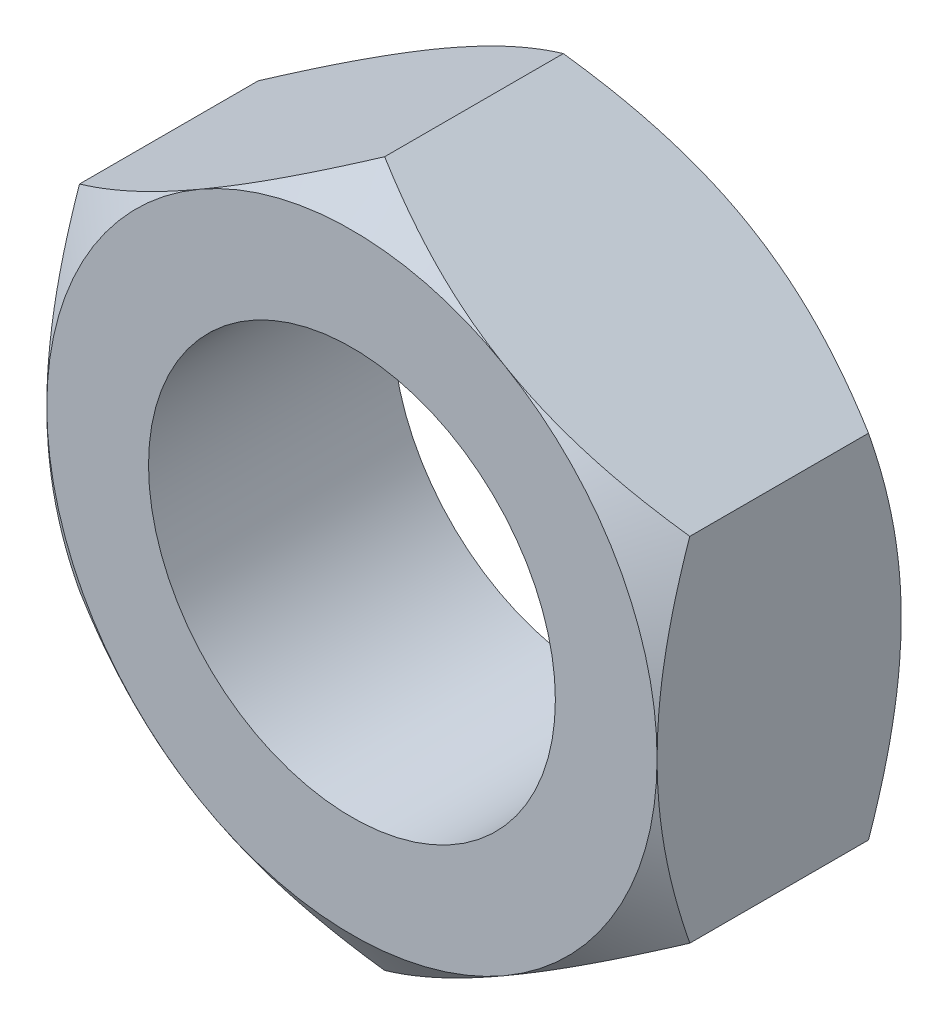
ISO-10303-21;
HEADER;
FILE_DESCRIPTION(('STEP AP214'),'2;1');
FILE_NAME('part.step','',(''),(''),'','','');
FILE_SCHEMA(('AUTOMOTIVE_DESIGN { 1 0 10303 214 1 1 1 1 }'));
ENDSEC;
DATA;
#1=APPLICATION_CONTEXT('core data for automotive mechanical design processes');
#2=APPLICATION_PROTOCOL_DEFINITION('international standard','automotive_design',2000,#1);
#3=PRODUCT_CONTEXT('',#1,'mechanical');
#4=PRODUCT('Part','Part','',(#3));
#5=PRODUCT_RELATED_PRODUCT_CATEGORY('part','',(#4));
#6=PRODUCT_DEFINITION_FORMATION('','',#4);
#7=PRODUCT_DEFINITION_CONTEXT('part definition',#1,'design');
#8=PRODUCT_DEFINITION('design','',#6,#7);
#9=PRODUCT_DEFINITION_SHAPE('','',#8);
#10=(LENGTH_UNIT() NAMED_UNIT(*) SI_UNIT(.MILLI.,.METRE.));
#11=(NAMED_UNIT(*) PLANE_ANGLE_UNIT() SI_UNIT($,.RADIAN.));
#12=(NAMED_UNIT(*) SI_UNIT($,.STERADIAN.) SOLID_ANGLE_UNIT());
#13=UNCERTAINTY_MEASURE_WITH_UNIT(LENGTH_MEASURE(1.E-05),#10,'distance_accuracy_value','');
#14=(GEOMETRIC_REPRESENTATION_CONTEXT(3) GLOBAL_UNCERTAINTY_ASSIGNED_CONTEXT((#13)) GLOBAL_UNIT_ASSIGNED_CONTEXT((#10,
#11,#12)) REPRESENTATION_CONTEXT('',''));
#15=CARTESIAN_POINT('',(0.,0.,0.));
#16=DIRECTION('',(0.,0.,1.));
#17=DIRECTION('',(1.,0.,0.));
#18=AXIS2_PLACEMENT_3D('',#15,#16,#17);
#19=CARTESIAN_POINT('',(0.,17.3205080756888,12.));
#20=DIRECTION('',(0.,0.,1.));
#21=DIRECTION('',(1.,0.,0.));
#22=AXIS2_PLACEMENT_3D('',#19,#20,#21);
#23=PLANE('',#22);
#24=CARTESIAN_POINT('',(0.,0.,12.));
#25=DIRECTION('',(0.,0.,-1.));
#26=DIRECTION('',(-1.,0.,0.));
#27=AXIS2_PLACEMENT_3D('',#24,#25,#26);
#28=CIRCLE('',#27,15.);
#29=CARTESIAN_POINT('',(15.,0.,12.));
#30=VERTEX_POINT('',#29);
#31=CARTESIAN_POINT('',(7.5,-12.9903810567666,12.));
#32=VERTEX_POINT('',#31);
#33=EDGE_CURVE('E116',#30,#32,#28,.T.);
#34=ORIENTED_EDGE('',*,*,#33,.F.);
#35=CARTESIAN_POINT('',(0.,0.,12.));
#36=DIRECTION('',(0.,0.,-1.));
#37=DIRECTION('',(-1.,0.,0.));
#38=AXIS2_PLACEMENT_3D('',#35,#36,#37);
#39=CIRCLE('',#38,15.);
#40=CARTESIAN_POINT('',(7.5,12.9903810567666,12.));
#41=VERTEX_POINT('',#40);
#42=EDGE_CURVE('E107',#41,#30,#39,.T.);
#43=ORIENTED_EDGE('',*,*,#42,.F.);
#44=CARTESIAN_POINT('',(0.,0.,12.));
#45=DIRECTION('',(0.,0.,-1.));
#46=DIRECTION('',(-1.,0.,0.));
#47=AXIS2_PLACEMENT_3D('',#44,#45,#46);
#48=CIRCLE('',#47,15.);
#49=CARTESIAN_POINT('',(-7.5,12.9903810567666,12.));
#50=VERTEX_POINT('',#49);
#51=EDGE_CURVE('E115',#50,#41,#48,.T.);
#52=ORIENTED_EDGE('',*,*,#51,.F.);
#53=CARTESIAN_POINT('',(0.,0.,12.));
#54=DIRECTION('',(0.,0.,-1.));
#55=DIRECTION('',(-1.,0.,0.));
#56=AXIS2_PLACEMENT_3D('',#53,#54,#55);
#57=CIRCLE('',#56,15.);
#58=CARTESIAN_POINT('',(-15.,0.,12.));
#59=VERTEX_POINT('',#58);
#60=EDGE_CURVE('E39',#59,#50,#57,.T.);
#61=ORIENTED_EDGE('',*,*,#60,.F.);
#62=CARTESIAN_POINT('',(0.,0.,12.));
#63=DIRECTION('',(0.,0.,-1.));
#64=DIRECTION('',(-1.,0.,0.));
#65=AXIS2_PLACEMENT_3D('',#62,#63,#64);
#66=CIRCLE('',#65,15.);
#67=CARTESIAN_POINT('',(-7.5,-12.9903810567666,12.));
#68=VERTEX_POINT('',#67);
#69=EDGE_CURVE('E138',#68,#59,#66,.T.);
#70=ORIENTED_EDGE('',*,*,#69,.F.);
#71=CARTESIAN_POINT('',(0.,0.,12.));
#72=DIRECTION('',(0.,0.,-1.));
#73=DIRECTION('',(-1.,0.,0.));
#74=AXIS2_PLACEMENT_3D('',#71,#72,#73);
#75=CIRCLE('',#74,15.);
#76=EDGE_CURVE('E136',#32,#68,#75,.T.);
#77=ORIENTED_EDGE('',*,*,#76,.F.);
#78=EDGE_LOOP('',(#34,#43,#52,#61,#70,#77));
#79=FACE_BOUND('',#78,.T.);
#80=CARTESIAN_POINT('',(0.,0.,12.));
#81=DIRECTION('',(0.,0.,1.));
#82=DIRECTION('',(1.,0.,0.));
#83=AXIS2_PLACEMENT_3D('',#80,#81,#82);
#84=CIRCLE('',#83,10.);
#85=CARTESIAN_POINT('',(10.,0.,12.));
#86=VERTEX_POINT('',#85);
#87=EDGE_CURVE('E144',#86,#86,#84,.T.);
#88=ORIENTED_EDGE('',*,*,#87,.F.);
#89=EDGE_LOOP('',(#88));
#90=FACE_BOUND('',#89,.T.);
#91=ADVANCED_FACE('F14',(#79,#90),#23,.T.);
#92=CARTESIAN_POINT('',(0.,17.3205080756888,0.));
#93=DIRECTION('',(0.,0.,1.));
#94=DIRECTION('',(1.,0.,0.));
#95=AXIS2_PLACEMENT_3D('',#92,#93,#94);
#96=PLANE('',#95);
#97=CARTESIAN_POINT('',(0.,0.,0.));
#98=DIRECTION('',(0.,0.,-1.));
#99=DIRECTION('',(-1.,0.,0.));
#100=AXIS2_PLACEMENT_3D('',#97,#98,#99);
#101=CIRCLE('',#100,15.);
#102=CARTESIAN_POINT('',(7.5,12.9903810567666,0.));
#103=VERTEX_POINT('',#102);
#104=CARTESIAN_POINT('',(15.,0.,0.));
#105=VERTEX_POINT('',#104);
#106=EDGE_CURVE('E275',#103,#105,#101,.T.);
#107=ORIENTED_EDGE('',*,*,#106,.T.);
#108=CARTESIAN_POINT('',(0.,0.,0.));
#109=DIRECTION('',(0.,0.,-1.));
#110=DIRECTION('',(-1.,0.,0.));
#111=AXIS2_PLACEMENT_3D('',#108,#109,#110);
#112=CIRCLE('',#111,15.);
#113=CARTESIAN_POINT('',(7.5,-12.9903810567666,0.));
#114=VERTEX_POINT('',#113);
#115=EDGE_CURVE('E282',#105,#114,#112,.T.);
#116=ORIENTED_EDGE('',*,*,#115,.T.);
#117=CARTESIAN_POINT('',(0.,0.,0.));
#118=DIRECTION('',(0.,0.,-1.));
#119=DIRECTION('',(-1.,0.,0.));
#120=AXIS2_PLACEMENT_3D('',#117,#118,#119);
#121=CIRCLE('',#120,15.);
#122=CARTESIAN_POINT('',(-7.5,-12.9903810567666,0.));
#123=VERTEX_POINT('',#122);
#124=EDGE_CURVE('E288',#114,#123,#121,.T.);
#125=ORIENTED_EDGE('',*,*,#124,.T.);
#126=CARTESIAN_POINT('',(0.,0.,0.));
#127=DIRECTION('',(0.,0.,-1.));
#128=DIRECTION('',(-1.,0.,0.));
#129=AXIS2_PLACEMENT_3D('',#126,#127,#128);
#130=CIRCLE('',#129,15.);
#131=CARTESIAN_POINT('',(-15.,0.,0.));
#132=VERTEX_POINT('',#131);
#133=EDGE_CURVE('E307',#123,#132,#130,.T.);
#134=ORIENTED_EDGE('',*,*,#133,.T.);
#135=CARTESIAN_POINT('',(0.,0.,0.));
#136=DIRECTION('',(0.,0.,-1.));
#137=DIRECTION('',(-1.,0.,0.));
#138=AXIS2_PLACEMENT_3D('',#135,#136,#137);
#139=CIRCLE('',#138,15.);
#140=CARTESIAN_POINT('',(-7.5,12.9903810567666,0.));
#141=VERTEX_POINT('',#140);
#142=EDGE_CURVE('E296',#132,#141,#139,.T.);
#143=ORIENTED_EDGE('',*,*,#142,.T.);
#144=CARTESIAN_POINT('',(0.,0.,0.));
#145=DIRECTION('',(0.,0.,-1.));
#146=DIRECTION('',(-1.,0.,0.));
#147=AXIS2_PLACEMENT_3D('',#144,#145,#146);
#148=CIRCLE('',#147,15.);
#149=EDGE_CURVE('E294',#141,#103,#148,.T.);
#150=ORIENTED_EDGE('',*,*,#149,.T.);
#151=EDGE_LOOP('',(#107,#116,#125,#134,#143,#150));
#152=FACE_BOUND('',#151,.T.);
#153=CARTESIAN_POINT('',(0.,0.,0.));
#154=DIRECTION('',(0.,0.,1.));
#155=DIRECTION('',(1.,0.,0.));
#156=AXIS2_PLACEMENT_3D('',#153,#154,#155);
#157=CIRCLE('',#156,10.);
#158=CARTESIAN_POINT('',(10.,0.,0.));
#159=VERTEX_POINT('',#158);
#160=EDGE_CURVE('E147',#159,#159,#157,.T.);
#161=ORIENTED_EDGE('',*,*,#160,.T.);
#162=EDGE_LOOP('',(#161));
#163=FACE_BOUND('',#162,.T.);
#164=ADVANCED_FACE('F291',(#152,#163),#96,.F.);
#165=CARTESIAN_POINT('',(15.,8.66025403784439,12.));
#166=DIRECTION('',(-0.5,-0.866025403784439,0.));
#167=DIRECTION('',(0.866025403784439,-0.5,0.));
#168=AXIS2_PLACEMENT_3D('',#165,#166,#167);
#169=PLANE('',#168);
#170=DIRECTION('',(0.,0.,-1.));
#171=VECTOR('',#170,1.);
#172=CARTESIAN_POINT('',(0.,17.3205080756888,12.));
#173=LINE('',#172,#171);
#174=CARTESIAN_POINT('',(0.,17.3205080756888,10.3923048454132));
#175=VERTEX_POINT('',#174);
#176=CARTESIAN_POINT('',(0.,17.3205080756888,1.60769515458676));
#177=VERTEX_POINT('',#176);
#178=EDGE_CURVE('E148',#175,#177,#173,.T.);
#179=ORIENTED_EDGE('',*,*,#178,.F.);
#180=CARTESIAN_POINT('',(0.,17.3205080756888,10.3923048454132));
#181=CARTESIAN_POINT('',(0.302482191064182,17.1458699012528,10.5132845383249));
#182=CARTESIAN_POINT('',(0.606465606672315,16.9703649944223,10.6294015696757));
#183=CARTESIAN_POINT('',(1.21755962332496,16.6175496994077,10.8505296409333));
#184=CARTESIAN_POINT('',(1.52467130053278,16.4402386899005,10.9555367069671));
#185=CARTESIAN_POINT('',(2.13971794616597,16.08514134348,11.1522680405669));
#186=CARTESIAN_POINT('',(2.44763122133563,15.9073675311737,11.2440821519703));
#187=CARTESIAN_POINT('',(3.06629979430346,15.5501790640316,11.4138304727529));
#188=CARTESIAN_POINT('',(3.37705484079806,15.3707645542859,11.491765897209));
#189=CARTESIAN_POINT('',(4.00171979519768,15.0101140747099,11.6324382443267));
#190=CARTESIAN_POINT('',(4.31563429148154,14.8288754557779,11.6951481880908));
#191=CARTESIAN_POINT('',(4.94562238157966,14.4651516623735,11.8038505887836));
#192=CARTESIAN_POINT('',(5.26169587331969,14.2826665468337,11.8498438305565));
#193=CARTESIAN_POINT('',(5.89767078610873,13.9154862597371,11.9242852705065));
#194=CARTESIAN_POINT('',(6.2175834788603,13.7307845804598,11.952607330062));
#195=CARTESIAN_POINT('',(6.69810191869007,13.4533571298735,11.9810040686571));
#196=CARTESIAN_POINT('',(6.85841465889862,13.3608005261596,11.9881219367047));
#197=CARTESIAN_POINT('',(7.17914916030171,13.1756243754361,11.9976218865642));
#198=CARTESIAN_POINT('',(7.33957092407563,13.0830048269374,12.0000038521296));
#199=CARTESIAN_POINT('',(7.5,12.9903810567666,12.));
#200=B_SPLINE_CURVE_WITH_KNOTS('',3,(#180,#181,#182,#183,#184,#185,#186,#187,#188,#189,#190,
#191,#192,#193,#194,#195,#196,#197,#198,#199),.UNSPECIFIED.,.F.,.F.,(4,2,2,2,2,2,2,2,2,4),(0.,
1.10893848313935,2.21827228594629,3.31965174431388,4.42093472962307,5.52415512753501,
6.6273237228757,7.7382793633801,8.29397650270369,8.84968728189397),.UNSPECIFIED.);
#201=EDGE_CURVE('E151',#175,#41,#200,.T.);
#202=ORIENTED_EDGE('',*,*,#201,.T.);
#203=CARTESIAN_POINT('',(7.5,12.9903810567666,12.));
#204=CARTESIAN_POINT('',(7.77919360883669,12.8291885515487,12.0000495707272));
#205=CARTESIAN_POINT('',(8.05837338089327,12.6680040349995,11.9928006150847));
#206=CARTESIAN_POINT('',(8.61612789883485,12.3459843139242,11.9640744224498));
#207=CARTESIAN_POINT('',(8.8947027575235,12.1851490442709,11.9426001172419));
#208=CARTESIAN_POINT('',(9.45029688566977,11.8643766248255,11.8858416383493));
#209=CARTESIAN_POINT('',(9.72731802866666,11.704438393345,11.8505818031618));
#210=CARTESIAN_POINT('',(10.2798627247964,11.3854265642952,11.76693101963));
#211=CARTESIAN_POINT('',(10.5553862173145,11.2263530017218,11.7185395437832));
#212=CARTESIAN_POINT('',(11.3736423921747,10.7539325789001,11.5559786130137));
#213=CARTESIAN_POINT('',(11.9137344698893,10.4421102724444,11.4238104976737));
#214=CARTESIAN_POINT('',(12.9851128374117,9.82354968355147,11.1186816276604));
#215=CARTESIAN_POINT('',(13.5163977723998,9.51681218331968,10.9457146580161));
#216=CARTESIAN_POINT('',(14.2032811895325,9.12023985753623,10.6985172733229));
#217=CARTESIAN_POINT('',(14.3630469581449,9.02799904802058,10.6393337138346));
#218=CARTESIAN_POINT('',(14.6820087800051,8.84384635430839,10.5179888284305));
#219=CARTESIAN_POINT('',(14.8412035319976,8.75193522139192,10.4558229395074));
#220=CARTESIAN_POINT('',(15.,8.66025403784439,10.3923048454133));
#221=B_SPLINE_CURVE_WITH_KNOTS('',3,(#203,#204,#205,#206,#207,#208,#209,#210,#211,#212,#213,
#214,#215,#216,#217,#218,#219,#220),.UNSPECIFIED.,.F.,.F.,(4,2,2,2,2,2,2,2,4),(0.,
0.967047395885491,1.93389554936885,2.89904437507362,3.86423197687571,5.77492419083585,
7.68590765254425,8.26712208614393,8.8492560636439),.UNSPECIFIED.);
#222=CARTESIAN_POINT('',(15.,8.66025403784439,10.3923048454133));
#223=VERTEX_POINT('',#222);
#224=EDGE_CURVE('E110',#41,#223,#221,.T.);
#225=ORIENTED_EDGE('',*,*,#224,.T.);
#226=DIRECTION('',(0.,0.,-1.));
#227=VECTOR('',#226,1.);
#228=CARTESIAN_POINT('',(15.,8.66025403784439,12.));
#229=LINE('',#228,#227);
#230=CARTESIAN_POINT('',(15.,8.66025403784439,1.60769515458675));
#231=VERTEX_POINT('',#230);
#232=EDGE_CURVE('E132',#223,#231,#229,.T.);
#233=ORIENTED_EDGE('',*,*,#232,.T.);
#234=CARTESIAN_POINT('',(15.,8.66025403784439,1.60769515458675));
#235=CARTESIAN_POINT('',(14.6975178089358,8.83489221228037,1.48671546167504));
#236=CARTESIAN_POINT('',(14.3935343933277,9.01039711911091,1.37059843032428));
#237=CARTESIAN_POINT('',(13.782440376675,9.36321241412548,1.14947035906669));
#238=CARTESIAN_POINT('',(13.4753286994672,9.54052342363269,1.04446329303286));
#239=CARTESIAN_POINT('',(12.860282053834,9.89562077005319,0.847731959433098));
#240=CARTESIAN_POINT('',(12.5523687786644,10.0733945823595,0.755917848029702));
#241=CARTESIAN_POINT('',(11.9337002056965,10.4305830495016,0.586169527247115));
#242=CARTESIAN_POINT('',(11.6229451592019,10.6099975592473,0.508234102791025));
#243=CARTESIAN_POINT('',(10.9982802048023,10.9706480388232,0.367561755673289));
#244=CARTESIAN_POINT('',(10.6843657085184,11.1518866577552,0.304851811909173));
#245=CARTESIAN_POINT('',(10.0543776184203,11.5156104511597,0.196149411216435));
#246=CARTESIAN_POINT('',(9.73830412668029,11.6980955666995,0.150156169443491));
#247=CARTESIAN_POINT('',(9.10232921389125,12.0652758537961,0.0757147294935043));
#248=CARTESIAN_POINT('',(8.78241652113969,12.2499775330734,0.0473926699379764));
#249=CARTESIAN_POINT('',(8.30189808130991,12.5274049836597,0.0189959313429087));
#250=CARTESIAN_POINT('',(8.14158534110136,12.6199615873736,0.0118780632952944));
#251=CARTESIAN_POINT('',(7.82085083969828,12.8051377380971,0.00237811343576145));
#252=CARTESIAN_POINT('',(7.66042907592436,12.8977572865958,-3.85212960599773E-06));
#253=CARTESIAN_POINT('',(7.5,12.9903810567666,0.));
#254=B_SPLINE_CURVE_WITH_KNOTS('',3,(#234,#235,#236,#237,#238,#239,#240,#241,#242,#243,#244,
#245,#246,#247,#248,#249,#250,#251,#252,#253),.UNSPECIFIED.,.F.,.F.,(4,2,2,2,2,2,2,2,2,4),(0.,
1.10893848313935,2.21827228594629,3.31965174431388,4.42093472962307,5.52415512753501,
6.6273237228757,7.7382793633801,8.29397650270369,8.84968728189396),.UNSPECIFIED.);
#255=EDGE_CURVE('E278',#231,#103,#254,.T.);
#256=ORIENTED_EDGE('',*,*,#255,.T.);
#257=CARTESIAN_POINT('',(7.5,12.9903810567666,0.));
#258=CARTESIAN_POINT('',(7.2208063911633,13.1515735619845,-4.95707271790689E-05));
#259=CARTESIAN_POINT('',(6.94162661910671,13.3127580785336,0.00719938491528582));
#260=CARTESIAN_POINT('',(6.38387210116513,13.6347777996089,0.0359255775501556));
#261=CARTESIAN_POINT('',(6.10529724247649,13.7956130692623,0.0573998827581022));
#262=CARTESIAN_POINT('',(5.54970311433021,14.1163854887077,0.114158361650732));
#263=CARTESIAN_POINT('',(5.27268197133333,14.2763237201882,0.149418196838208));
#264=CARTESIAN_POINT('',(4.72013727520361,14.595335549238,0.233068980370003));
#265=CARTESIAN_POINT('',(4.44461378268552,14.7544091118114,0.281460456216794));
#266=CARTESIAN_POINT('',(3.62635760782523,15.226829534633,0.44402138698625));
#267=CARTESIAN_POINT('',(3.08626553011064,15.5386518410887,0.576189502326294));
#268=CARTESIAN_POINT('',(2.0148871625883,16.1572124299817,0.881318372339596));
#269=CARTESIAN_POINT('',(1.48360222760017,16.4639499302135,1.05428534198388));
#270=CARTESIAN_POINT('',(0.796718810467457,16.860522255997,1.3014827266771));
#271=CARTESIAN_POINT('',(0.636953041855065,16.9527630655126,1.36066628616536));
#272=CARTESIAN_POINT('',(0.317991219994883,17.1369157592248,1.48201117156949));
#273=CARTESIAN_POINT('',(0.158796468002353,17.2288268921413,1.5441770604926));
#274=CARTESIAN_POINT('',(0.,17.3205080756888,1.60769515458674));
#275=B_SPLINE_CURVE_WITH_KNOTS('',3,(#257,#258,#259,#260,#261,#262,#263,#264,#265,#266,#267,
#268,#269,#270,#271,#272,#273,#274),.UNSPECIFIED.,.F.,.F.,(4,2,2,2,2,2,2,2,4),(0.,
0.967047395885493,1.93389554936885,2.89904437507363,3.86423197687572,5.77492419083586,
7.68590765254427,8.26712208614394,8.84925606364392),.UNSPECIFIED.);
#276=EDGE_CURVE('E299',#103,#177,#275,.T.);
#277=ORIENTED_EDGE('',*,*,#276,.T.);
#278=EDGE_LOOP('',(#179,#202,#225,#233,#256,#277));
#279=FACE_BOUND('',#278,.T.);
#280=ADVANCED_FACE('F165',(#279),#169,.F.);
#281=CARTESIAN_POINT('',(0.,17.3205080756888,12.));
#282=DIRECTION('',(0.5,-0.866025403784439,0.));
#283=DIRECTION('',(0.866025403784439,0.5,0.));
#284=AXIS2_PLACEMENT_3D('',#281,#282,#283);
#285=PLANE('',#284);
#286=DIRECTION('',(0.,0.,-1.));
#287=VECTOR('',#286,1.);
#288=CARTESIAN_POINT('',(-15.,8.66025403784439,12.));
#289=LINE('',#288,#287);
#290=CARTESIAN_POINT('',(-15.,8.66025403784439,10.3923048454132));
#291=VERTEX_POINT('',#290);
#292=CARTESIAN_POINT('',(-15.,8.66025403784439,1.60769515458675));
#293=VERTEX_POINT('',#292);
#294=EDGE_CURVE('E150',#291,#293,#289,.T.);
#295=ORIENTED_EDGE('',*,*,#294,.F.);
#296=CARTESIAN_POINT('',(-15.,8.66025403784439,10.3923048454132));
#297=CARTESIAN_POINT('',(-14.6975178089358,8.83489221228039,10.5132845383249));
#298=CARTESIAN_POINT('',(-14.3935343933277,9.01039711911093,10.6294015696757));
#299=CARTESIAN_POINT('',(-13.782440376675,9.36321241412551,10.8505296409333));
#300=CARTESIAN_POINT('',(-13.4753286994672,9.54052342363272,10.9555367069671));
#301=CARTESIAN_POINT('',(-12.860282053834,9.89562077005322,11.1522680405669));
#302=CARTESIAN_POINT('',(-12.5523687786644,10.0733945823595,11.2440821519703));
#303=CARTESIAN_POINT('',(-11.9337002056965,10.4305830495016,11.4138304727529));
#304=CARTESIAN_POINT('',(-11.6229451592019,10.6099975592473,11.4917658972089));
#305=CARTESIAN_POINT('',(-10.9982802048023,10.9706480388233,11.6324382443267));
#306=CARTESIAN_POINT('',(-10.6843657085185,11.1518866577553,11.6951481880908));
#307=CARTESIAN_POINT('',(-10.0543776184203,11.5156104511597,11.8038505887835));
#308=CARTESIAN_POINT('',(-9.7383041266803,11.6980955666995,11.8498438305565));
#309=CARTESIAN_POINT('',(-9.10232921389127,12.0652758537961,11.9242852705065));
#310=CARTESIAN_POINT('',(-8.7824165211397,12.2499775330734,11.952607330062));
#311=CARTESIAN_POINT('',(-8.30189808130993,12.5274049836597,11.9810040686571));
#312=CARTESIAN_POINT('',(-8.14158534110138,12.6199615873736,11.9881219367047));
#313=CARTESIAN_POINT('',(-7.82085083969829,12.8051377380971,11.9976218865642));
#314=CARTESIAN_POINT('',(-7.66042907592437,12.8977572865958,12.0000038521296));
#315=CARTESIAN_POINT('',(-7.5,12.9903810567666,12.));
#316=B_SPLINE_CURVE_WITH_KNOTS('',3,(#296,#297,#298,#299,#300,#301,#302,#303,#304,#305,#306,
#307,#308,#309,#310,#311,#312,#313,#314,#315),.UNSPECIFIED.,.F.,.F.,(4,2,2,2,2,2,2,2,2,4),(0.,
1.10893848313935,2.21827228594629,3.31965174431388,4.42093472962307,5.52415512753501,
6.6273237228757,7.7382793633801,8.29397650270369,8.84968728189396),.UNSPECIFIED.);
#317=EDGE_CURVE('E180',#291,#50,#316,.T.);
#318=ORIENTED_EDGE('',*,*,#317,.T.);
#319=CARTESIAN_POINT('',(-7.5,12.9903810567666,12.));
#320=CARTESIAN_POINT('',(-7.22080639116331,13.1515735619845,12.0000495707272));
#321=CARTESIAN_POINT('',(-6.94162661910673,13.3127580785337,11.9928006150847));
#322=CARTESIAN_POINT('',(-6.38387210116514,13.634777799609,11.9640744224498));
#323=CARTESIAN_POINT('',(-6.1052972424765,13.7956130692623,11.9426001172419));
#324=CARTESIAN_POINT('',(-5.54970311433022,14.1163854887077,11.8858416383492));
#325=CARTESIAN_POINT('',(-5.27268197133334,14.2763237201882,11.8505818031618));
#326=CARTESIAN_POINT('',(-4.72013727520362,14.595335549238,11.76693101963));
#327=CARTESIAN_POINT('',(-4.44461378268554,14.7544091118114,11.7185395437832));
#328=CARTESIAN_POINT('',(-3.62635760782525,15.2268295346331,11.5559786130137));
#329=CARTESIAN_POINT('',(-3.08626553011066,15.5386518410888,11.4238104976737));
#330=CARTESIAN_POINT('',(-2.0148871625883,16.1572124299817,11.1186816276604));
#331=CARTESIAN_POINT('',(-1.48360222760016,16.4639499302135,10.9457146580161));
#332=CARTESIAN_POINT('',(-0.796718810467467,16.860522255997,10.6985172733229));
#333=CARTESIAN_POINT('',(-0.636953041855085,16.9527630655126,10.6393337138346));
#334=CARTESIAN_POINT('',(-0.317991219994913,17.1369157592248,10.5179888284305));
#335=CARTESIAN_POINT('',(-0.158796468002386,17.2288268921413,10.4558229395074));
#336=CARTESIAN_POINT('',(0.,17.3205080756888,10.3923048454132));
#337=B_SPLINE_CURVE_WITH_KNOTS('',3,(#319,#320,#321,#322,#323,#324,#325,#326,#327,#328,#329,
#330,#331,#332,#333,#334,#335,#336),.UNSPECIFIED.,.F.,.F.,(4,2,2,2,2,2,2,2,4),(0.,
0.967047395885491,1.93389554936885,2.89904437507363,3.86423197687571,5.77492419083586,
7.68590765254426,8.26712208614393,8.84925606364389),.UNSPECIFIED.);
#338=EDGE_CURVE('E188',#50,#175,#337,.T.);
#339=ORIENTED_EDGE('',*,*,#338,.T.);
#340=ORIENTED_EDGE('',*,*,#178,.T.);
#341=CARTESIAN_POINT('',(0.,17.3205080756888,1.60769515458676));
#342=CARTESIAN_POINT('',(-0.302482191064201,17.1458699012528,1.48671546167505));
#343=CARTESIAN_POINT('',(-0.606465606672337,16.9703649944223,1.37059843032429));
#344=CARTESIAN_POINT('',(-1.21755962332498,16.6175496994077,1.14947035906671));
#345=CARTESIAN_POINT('',(-1.5246713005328,16.4402386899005,1.04446329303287));
#346=CARTESIAN_POINT('',(-2.13971794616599,16.08514134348,0.847731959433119));
#347=CARTESIAN_POINT('',(-2.44763122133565,15.9073675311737,0.755917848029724));
#348=CARTESIAN_POINT('',(-3.06629979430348,15.5501790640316,0.586169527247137));
#349=CARTESIAN_POINT('',(-3.37705484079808,15.3707645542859,0.508234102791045));
#350=CARTESIAN_POINT('',(-4.0017197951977,15.01011407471,0.367561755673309));
#351=CARTESIAN_POINT('',(-4.31563429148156,14.828875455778,0.304851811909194));
#352=CARTESIAN_POINT('',(-4.94562238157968,14.4651516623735,0.196149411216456));
#353=CARTESIAN_POINT('',(-5.26169587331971,14.2826665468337,0.150156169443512));
#354=CARTESIAN_POINT('',(-5.89767078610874,13.9154862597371,0.0757147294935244));
#355=CARTESIAN_POINT('',(-6.21758347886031,13.7307845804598,0.0473926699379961));
#356=CARTESIAN_POINT('',(-6.69810191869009,13.4533571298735,0.0189959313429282));
#357=CARTESIAN_POINT('',(-6.85841465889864,13.3608005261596,0.0118780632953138));
#358=CARTESIAN_POINT('',(-7.17914916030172,13.1756243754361,0.00237811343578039));
#359=CARTESIAN_POINT('',(-7.33957092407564,13.0830048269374,-3.85212958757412E-06));
#360=CARTESIAN_POINT('',(-7.5,12.9903810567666,0.));
#361=B_SPLINE_CURVE_WITH_KNOTS('',3,(#341,#342,#343,#344,#345,#346,#347,#348,#349,#350,#351,
#352,#353,#354,#355,#356,#357,#358,#359,#360),.UNSPECIFIED.,.F.,.F.,(4,2,2,2,2,2,2,2,2,4),(0.,
1.10893848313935,2.21827228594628,3.31965174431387,4.42093472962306,5.524155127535,
6.62732372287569,7.73827936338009,8.29397650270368,8.84968728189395),.UNSPECIFIED.);
#362=EDGE_CURVE('E332',#177,#141,#361,.T.);
#363=ORIENTED_EDGE('',*,*,#362,.T.);
#364=CARTESIAN_POINT('',(-7.5,12.9903810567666,0.));
#365=CARTESIAN_POINT('',(-7.7791936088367,12.8291885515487,-4.95707271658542E-05));
#366=CARTESIAN_POINT('',(-8.05837338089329,12.6680040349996,0.00719938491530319));
#367=CARTESIAN_POINT('',(-8.61612789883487,12.3459843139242,0.0359255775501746));
#368=CARTESIAN_POINT('',(-8.89470275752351,12.1851490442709,0.0573998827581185));
#369=CARTESIAN_POINT('',(-9.45029688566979,11.8643766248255,0.114158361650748));
#370=CARTESIAN_POINT('',(-9.72731802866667,11.704438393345,0.149418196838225));
#371=CARTESIAN_POINT('',(-10.2798627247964,11.3854265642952,0.23306898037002));
#372=CARTESIAN_POINT('',(-10.5553862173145,11.2263530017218,0.28146045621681));
#373=CARTESIAN_POINT('',(-11.3736423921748,10.7539325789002,0.444021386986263));
#374=CARTESIAN_POINT('',(-11.9137344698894,10.4421102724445,0.576189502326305));
#375=CARTESIAN_POINT('',(-12.9851128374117,9.8235496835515,0.881318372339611));
#376=CARTESIAN_POINT('',(-13.5163977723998,9.5168121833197,1.0542853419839));
#377=CARTESIAN_POINT('',(-14.2032811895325,9.12023985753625,1.30148272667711));
#378=CARTESIAN_POINT('',(-14.3630469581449,9.0279990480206,1.36066628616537));
#379=CARTESIAN_POINT('',(-14.6820087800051,8.84384635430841,1.4820111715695));
#380=CARTESIAN_POINT('',(-14.8412035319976,8.75193522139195,1.54417706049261));
#381=CARTESIAN_POINT('',(-15.,8.66025403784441,1.60769515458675));
#382=B_SPLINE_CURVE_WITH_KNOTS('',3,(#364,#365,#366,#367,#368,#369,#370,#371,#372,#373,#374,
#375,#376,#377,#378,#379,#380,#381),.UNSPECIFIED.,.F.,.F.,(4,2,2,2,2,2,2,2,4),(0.,
0.967047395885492,1.93389554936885,2.89904437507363,3.86423197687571,5.77492419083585,
7.68590765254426,8.26712208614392,8.84925606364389),.UNSPECIFIED.);
#383=EDGE_CURVE('E326',#141,#293,#382,.T.);
#384=ORIENTED_EDGE('',*,*,#383,.T.);
#385=EDGE_LOOP('',(#295,#318,#339,#340,#363,#384));
#386=FACE_BOUND('',#385,.T.);
#387=ADVANCED_FACE('F338',(#386),#285,.F.);
#388=CARTESIAN_POINT('',(-15.,8.66025403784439,12.));
#389=DIRECTION('',(1.,0.,0.));
#390=DIRECTION('',(0.,1.,0.));
#391=AXIS2_PLACEMENT_3D('',#388,#389,#390);
#392=PLANE('',#391);
#393=DIRECTION('',(0.,0.,-1.));
#394=VECTOR('',#393,1.);
#395=CARTESIAN_POINT('',(-15.,-8.66025403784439,12.));
#396=LINE('',#395,#394);
#397=CARTESIAN_POINT('',(-15.,-8.66025403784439,10.3923048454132));
#398=VERTEX_POINT('',#397);
#399=CARTESIAN_POINT('',(-15.,-8.66025403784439,1.60769515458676));
#400=VERTEX_POINT('',#399);
#401=EDGE_CURVE('E312',#398,#400,#396,.T.);
#402=ORIENTED_EDGE('',*,*,#401,.F.);
#403=CARTESIAN_POINT('',(-15.,-8.66025403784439,10.3923048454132));
#404=CARTESIAN_POINT('',(-15.,-8.31097768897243,10.5132845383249));
#405=CARTESIAN_POINT('',(-15.,-7.95996787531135,10.6294015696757));
#406=CARTESIAN_POINT('',(-15.,-7.25433728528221,10.8505296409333));
#407=CARTESIAN_POINT('',(-15.,-6.89971526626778,10.9555367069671));
#408=CARTESIAN_POINT('',(-15.,-6.18952057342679,11.1522680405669));
#409=CARTESIAN_POINT('',(-15.,-5.83397294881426,11.2440821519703));
#410=CARTESIAN_POINT('',(-15.,-5.11959601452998,11.4138304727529));
#411=CARTESIAN_POINT('',(-15.,-4.7607669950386,11.491765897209));
#412=CARTESIAN_POINT('',(-15.,-4.03946603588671,11.6324382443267));
#413=CARTESIAN_POINT('',(-15.,-3.67698879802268,11.6951481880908));
#414=CARTESIAN_POINT('',(-15.,-2.94954121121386,11.8038505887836));
#415=CARTESIAN_POINT('',(-15.,-2.58457098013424,11.8498438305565));
#416=CARTESIAN_POINT('',(-15.,-1.85021040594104,11.9242852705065));
#417=CARTESIAN_POINT('',(-15.,-1.48080704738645,11.952607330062));
#418=CARTESIAN_POINT('',(-15.,-0.925952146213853,11.9810040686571));
#419=CARTESIAN_POINT('',(-15.,-0.740838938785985,11.9881219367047));
#420=CARTESIAN_POINT('',(-15.,-0.370486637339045,11.9976218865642));
#421=CARTESIAN_POINT('',(-15.,-0.185247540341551,12.0000038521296));
#422=CARTESIAN_POINT('',(-15.,0.,12.));
#423=B_SPLINE_CURVE_WITH_KNOTS('',3,(#403,#404,#405,#406,#407,#408,#409,#410,#411,#412,#413,
#414,#415,#416,#417,#418,#419,#420,#421,#422),.UNSPECIFIED.,.F.,.F.,(4,2,2,2,2,2,2,2,2,4),(0.,
1.10893848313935,2.21827228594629,3.31965174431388,4.42093472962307,5.52415512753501,
6.6273237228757,7.7382793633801,8.29397650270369,8.84968728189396),.UNSPECIFIED.);
#424=EDGE_CURVE('E196',#398,#59,#423,.T.);
#425=ORIENTED_EDGE('',*,*,#424,.T.);
#426=CARTESIAN_POINT('',(-15.,0.,12.));
#427=CARTESIAN_POINT('',(-15.,0.322385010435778,12.0000495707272));
#428=CARTESIAN_POINT('',(-15.,0.644754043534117,11.9928006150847));
#429=CARTESIAN_POINT('',(-15.,1.28879348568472,11.9640744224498));
#430=CARTESIAN_POINT('',(-15.,1.61046402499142,11.9426001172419));
#431=CARTESIAN_POINT('',(-15.,2.25200886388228,11.8858416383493));
#432=CARTESIAN_POINT('',(-15.,2.57188532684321,11.8505818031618));
#433=CARTESIAN_POINT('',(-15.,3.2099089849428,11.76693101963));
#434=CARTESIAN_POINT('',(-15.,3.52805611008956,11.7185395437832));
#435=CARTESIAN_POINT('',(-15.,4.47289695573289,11.5559786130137));
#436=CARTESIAN_POINT('',(-15.,5.09654156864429,11.4238104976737));
#437=CARTESIAN_POINT('',(-15.,6.33366274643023,11.1186816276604));
#438=CARTESIAN_POINT('',(-15.,6.94713774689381,10.9457146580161));
#439=CARTESIAN_POINT('',(-15.,7.74028239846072,10.6985172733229));
#440=CARTESIAN_POINT('',(-15.,7.92476401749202,10.6393337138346));
#441=CARTESIAN_POINT('',(-15.,8.2930694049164,10.5179888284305));
#442=CARTESIAN_POINT('',(-15.,8.47689167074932,10.4558229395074));
#443=CARTESIAN_POINT('',(-15.,8.66025403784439,10.3923048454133));
#444=B_SPLINE_CURVE_WITH_KNOTS('',3,(#426,#427,#428,#429,#430,#431,#432,#433,#434,#435,#436,
#437,#438,#439,#440,#441,#442,#443),.UNSPECIFIED.,.F.,.F.,(4,2,2,2,2,2,2,2,4),(0.,
0.967047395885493,1.93389554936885,2.89904437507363,3.86423197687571,5.77492419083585,
7.68590765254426,8.26712208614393,8.84925606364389),.UNSPECIFIED.);
#445=EDGE_CURVE('E205',#59,#291,#444,.T.);
#446=ORIENTED_EDGE('',*,*,#445,.T.);
#447=ORIENTED_EDGE('',*,*,#294,.T.);
#448=CARTESIAN_POINT('',(-15.,8.66025403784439,1.60769515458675));
#449=CARTESIAN_POINT('',(-15.,8.31097768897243,1.48671546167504));
#450=CARTESIAN_POINT('',(-15.,7.95996787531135,1.37059843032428));
#451=CARTESIAN_POINT('',(-15.,7.25433728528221,1.14947035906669));
#452=CARTESIAN_POINT('',(-15.,6.89971526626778,1.04446329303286));
#453=CARTESIAN_POINT('',(-15.,6.18952057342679,0.847731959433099));
#454=CARTESIAN_POINT('',(-15.,5.83397294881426,0.755917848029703));
#455=CARTESIAN_POINT('',(-15.,5.11959601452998,0.586169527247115));
#456=CARTESIAN_POINT('',(-15.,4.7607669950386,0.508234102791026));
#457=CARTESIAN_POINT('',(-15.,4.03946603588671,0.36756175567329));
#458=CARTESIAN_POINT('',(-15.,3.67698879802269,0.304851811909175));
#459=CARTESIAN_POINT('',(-15.,2.94954121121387,0.196149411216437));
#460=CARTESIAN_POINT('',(-15.,2.58457098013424,0.150156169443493));
#461=CARTESIAN_POINT('',(-15.,1.85021040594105,0.0757147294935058));
#462=CARTESIAN_POINT('',(-15.,1.48080704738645,0.0473926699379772));
#463=CARTESIAN_POINT('',(-15.,0.925952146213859,0.0189959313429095));
#464=CARTESIAN_POINT('',(-15.,0.740838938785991,0.0118780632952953));
#465=CARTESIAN_POINT('',(-15.,0.370486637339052,0.00237811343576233));
#466=CARTESIAN_POINT('',(-15.,0.185247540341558,-3.85212960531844E-06));
#467=CARTESIAN_POINT('',(-15.,0.,0.));
#468=B_SPLINE_CURVE_WITH_KNOTS('',3,(#448,#449,#450,#451,#452,#453,#454,#455,#456,#457,#458,
#459,#460,#461,#462,#463,#464,#465,#466,#467),.UNSPECIFIED.,.F.,.F.,(4,2,2,2,2,2,2,2,2,4),(0.,
1.10893848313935,2.21827228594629,3.31965174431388,4.42093472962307,5.524155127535,
6.62732372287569,7.73827936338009,8.29397650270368,8.84968728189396),.UNSPECIFIED.);
#469=EDGE_CURVE('E333',#293,#132,#468,.T.);
#470=ORIENTED_EDGE('',*,*,#469,.T.);
#471=CARTESIAN_POINT('',(-15.,0.,0.));
#472=CARTESIAN_POINT('',(-15.,-0.322385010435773,-4.95707271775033E-05));
#473=CARTESIAN_POINT('',(-15.,-0.644754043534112,0.00719938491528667));
#474=CARTESIAN_POINT('',(-15.,-1.28879348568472,0.0359255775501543));
#475=CARTESIAN_POINT('',(-15.,-1.61046402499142,0.0573998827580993));
#476=CARTESIAN_POINT('',(-15.,-2.25200886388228,0.114158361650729));
#477=CARTESIAN_POINT('',(-15.,-2.57188532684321,0.149418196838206));
#478=CARTESIAN_POINT('',(-15.,-3.20990898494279,0.233068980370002));
#479=CARTESIAN_POINT('',(-15.,-3.52805611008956,0.281460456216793));
#480=CARTESIAN_POINT('',(-15.,-4.47289695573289,0.444021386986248));
#481=CARTESIAN_POINT('',(-15.,-5.09654156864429,0.576189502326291));
#482=CARTESIAN_POINT('',(-15.,-6.33366274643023,0.881318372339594));
#483=CARTESIAN_POINT('',(-15.,-6.94713774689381,1.05428534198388));
#484=CARTESIAN_POINT('',(-15.,-7.74028239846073,1.30148272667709));
#485=CARTESIAN_POINT('',(-15.,-7.92476401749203,1.36066628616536));
#486=CARTESIAN_POINT('',(-15.,-8.2930694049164,1.48201117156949));
#487=CARTESIAN_POINT('',(-15.,-8.47689167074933,1.5441770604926));
#488=CARTESIAN_POINT('',(-15.,-8.6602540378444,1.60769515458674));
#489=B_SPLINE_CURVE_WITH_KNOTS('',3,(#471,#472,#473,#474,#475,#476,#477,#478,#479,#480,#481,
#482,#483,#484,#485,#486,#487,#488),.UNSPECIFIED.,.F.,.F.,(4,2,2,2,2,2,2,2,4),(0.,
0.967047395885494,1.93389554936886,2.89904437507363,3.86423197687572,5.77492419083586,
7.68590765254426,8.26712208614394,8.84925606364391),.UNSPECIFIED.);
#490=EDGE_CURVE('E358',#132,#400,#489,.T.);
#491=ORIENTED_EDGE('',*,*,#490,.T.);
#492=EDGE_LOOP('',(#402,#425,#446,#447,#470,#491));
#493=FACE_BOUND('',#492,.T.);
#494=ADVANCED_FACE('F341',(#493),#392,.F.);
#495=CARTESIAN_POINT('',(-15.,-8.66025403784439,12.));
#496=DIRECTION('',(0.5,0.866025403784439,0.));
#497=DIRECTION('',(-0.866025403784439,0.5,0.));
#498=AXIS2_PLACEMENT_3D('',#495,#496,#497);
#499=PLANE('',#498);
#500=DIRECTION('',(0.,0.,-1.));
#501=VECTOR('',#500,1.);
#502=CARTESIAN_POINT('',(0.,-17.3205080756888,12.));
#503=LINE('',#502,#501);
#504=CARTESIAN_POINT('',(0.,-17.3205080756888,10.3923048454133));
#505=VERTEX_POINT('',#504);
#506=CARTESIAN_POINT('',(0.,-17.3205080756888,1.60769515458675));
#507=VERTEX_POINT('',#506);
#508=EDGE_CURVE('E318',#505,#507,#503,.T.);
#509=ORIENTED_EDGE('',*,*,#508,.F.);
#510=CARTESIAN_POINT('',(0.,-17.3205080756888,10.3923048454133));
#511=CARTESIAN_POINT('',(-0.302482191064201,-17.1458699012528,10.513284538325));
#512=CARTESIAN_POINT('',(-0.606465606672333,-16.9703649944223,10.6294015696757));
#513=CARTESIAN_POINT('',(-1.21755962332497,-16.6175496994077,10.8505296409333));
#514=CARTESIAN_POINT('',(-1.52467130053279,-16.4402386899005,10.9555367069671));
#515=CARTESIAN_POINT('',(-2.13971794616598,-16.08514134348,11.1522680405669));
#516=CARTESIAN_POINT('',(-2.44763122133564,-15.9073675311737,11.2440821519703));
#517=CARTESIAN_POINT('',(-3.06629979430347,-15.5501790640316,11.4138304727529));
#518=CARTESIAN_POINT('',(-3.37705484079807,-15.3707645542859,11.491765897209));
#519=CARTESIAN_POINT('',(-4.00171979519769,-15.0101140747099,11.6324382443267));
#520=CARTESIAN_POINT('',(-4.31563429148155,-14.8288754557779,11.6951481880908));
#521=CARTESIAN_POINT('',(-4.94562238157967,-14.4651516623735,11.8038505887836));
#522=CARTESIAN_POINT('',(-5.2616958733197,-14.2826665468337,11.8498438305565));
#523=CARTESIAN_POINT('',(-5.89767078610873,-13.9154862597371,11.9242852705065));
#524=CARTESIAN_POINT('',(-6.2175834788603,-13.7307845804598,11.952607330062));
#525=CARTESIAN_POINT('',(-6.69810191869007,-13.4533571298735,11.9810040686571));
#526=CARTESIAN_POINT('',(-6.85841465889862,-13.3608005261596,11.9881219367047));
#527=CARTESIAN_POINT('',(-7.17914916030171,-13.1756243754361,11.9976218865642));
#528=CARTESIAN_POINT('',(-7.33957092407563,-13.0830048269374,12.0000038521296));
#529=CARTESIAN_POINT('',(-7.5,-12.9903810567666,12.));
#530=B_SPLINE_CURVE_WITH_KNOTS('',3,(#510,#511,#512,#513,#514,#515,#516,#517,#518,#519,#520,
#521,#522,#523,#524,#525,#526,#527,#528,#529),.UNSPECIFIED.,.F.,.F.,(4,2,2,2,2,2,2,2,2,4),(0.,
1.10893848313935,2.21827228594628,3.31965174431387,4.42093472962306,5.52415512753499,
6.62732372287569,7.73827936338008,8.29397650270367,8.84968728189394),.UNSPECIFIED.);
#531=EDGE_CURVE('E213',#505,#68,#530,.T.);
#532=ORIENTED_EDGE('',*,*,#531,.T.);
#533=CARTESIAN_POINT('',(-7.5,-12.9903810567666,12.));
#534=CARTESIAN_POINT('',(-7.77919360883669,-12.8291885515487,12.0000495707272));
#535=CARTESIAN_POINT('',(-8.05837338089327,-12.6680040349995,11.9928006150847));
#536=CARTESIAN_POINT('',(-8.61612789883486,-12.3459843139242,11.9640744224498));
#537=CARTESIAN_POINT('',(-8.8947027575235,-12.1851490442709,11.9426001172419));
#538=CARTESIAN_POINT('',(-9.45029688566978,-11.8643766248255,11.8858416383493));
#539=CARTESIAN_POINT('',(-9.72731802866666,-11.704438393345,11.8505818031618));
#540=CARTESIAN_POINT('',(-10.2798627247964,-11.3854265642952,11.76693101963));
#541=CARTESIAN_POINT('',(-10.5553862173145,-11.2263530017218,11.7185395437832));
#542=CARTESIAN_POINT('',(-11.3736423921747,-10.7539325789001,11.5559786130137));
#543=CARTESIAN_POINT('',(-11.9137344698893,-10.4421102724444,11.4238104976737));
#544=CARTESIAN_POINT('',(-12.9851128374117,-9.82354968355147,11.1186816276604));
#545=CARTESIAN_POINT('',(-13.5163977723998,-9.51681218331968,10.9457146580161));
#546=CARTESIAN_POINT('',(-14.2032811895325,-9.12023985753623,10.6985172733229));
#547=CARTESIAN_POINT('',(-14.3630469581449,-9.02799904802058,10.6393337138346));
#548=CARTESIAN_POINT('',(-14.6820087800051,-8.84384635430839,10.5179888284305));
#549=CARTESIAN_POINT('',(-14.8412035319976,-8.75193522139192,10.4558229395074));
#550=CARTESIAN_POINT('',(-15.,-8.66025403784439,10.3923048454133));
#551=B_SPLINE_CURVE_WITH_KNOTS('',3,(#533,#534,#535,#536,#537,#538,#539,#540,#541,#542,#543,
#544,#545,#546,#547,#548,#549,#550),.UNSPECIFIED.,.F.,.F.,(4,2,2,2,2,2,2,2,4),(0.,
0.967047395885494,1.93389554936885,2.89904437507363,3.86423197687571,5.77492419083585,
7.68590765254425,8.26712208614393,8.8492560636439),.UNSPECIFIED.);
#552=EDGE_CURVE('E222',#68,#398,#551,.T.);
#553=ORIENTED_EDGE('',*,*,#552,.T.);
#554=ORIENTED_EDGE('',*,*,#401,.T.);
#555=CARTESIAN_POINT('',(-15.,-8.66025403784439,1.60769515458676));
#556=CARTESIAN_POINT('',(-14.6975178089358,-8.83489221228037,1.48671546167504));
#557=CARTESIAN_POINT('',(-14.3935343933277,-9.01039711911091,1.37059843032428));
#558=CARTESIAN_POINT('',(-13.782440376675,-9.36321241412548,1.14947035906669));
#559=CARTESIAN_POINT('',(-13.4753286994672,-9.54052342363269,1.04446329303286));
#560=CARTESIAN_POINT('',(-12.860282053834,-9.89562077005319,0.847731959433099));
#561=CARTESIAN_POINT('',(-12.5523687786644,-10.0733945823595,0.755917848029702));
#562=CARTESIAN_POINT('',(-11.9337002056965,-10.4305830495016,0.586169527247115));
#563=CARTESIAN_POINT('',(-11.6229451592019,-10.6099975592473,0.508234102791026));
#564=CARTESIAN_POINT('',(-10.9982802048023,-10.9706480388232,0.36756175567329));
#565=CARTESIAN_POINT('',(-10.6843657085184,-11.1518866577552,0.304851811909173));
#566=CARTESIAN_POINT('',(-10.0543776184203,-11.5156104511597,0.196149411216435));
#567=CARTESIAN_POINT('',(-9.73830412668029,-11.6980955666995,0.150156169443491));
#568=CARTESIAN_POINT('',(-9.10232921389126,-12.0652758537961,0.0757147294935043));
#569=CARTESIAN_POINT('',(-8.78241652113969,-12.2499775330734,0.0473926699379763));
#570=CARTESIAN_POINT('',(-8.30189808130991,-12.5274049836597,0.0189959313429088));
#571=CARTESIAN_POINT('',(-8.14158534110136,-12.6199615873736,0.0118780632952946));
#572=CARTESIAN_POINT('',(-7.82085083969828,-12.8051377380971,0.00237811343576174));
#573=CARTESIAN_POINT('',(-7.66042907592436,-12.8977572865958,-3.8521296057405E-06));
#574=CARTESIAN_POINT('',(-7.5,-12.9903810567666,0.));
#575=B_SPLINE_CURVE_WITH_KNOTS('',3,(#555,#556,#557,#558,#559,#560,#561,#562,#563,#564,#565,
#566,#567,#568,#569,#570,#571,#572,#573,#574),.UNSPECIFIED.,.F.,.F.,(4,2,2,2,2,2,2,2,2,4),(0.,
1.10893848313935,2.21827228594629,3.31965174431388,4.42093472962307,5.52415512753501,
6.6273237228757,7.7382793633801,8.29397650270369,8.84968728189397),.UNSPECIFIED.);
#576=EDGE_CURVE('E364',#400,#123,#575,.T.);
#577=ORIENTED_EDGE('',*,*,#576,.T.);
#578=CARTESIAN_POINT('',(-7.5,-12.9903810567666,0.));
#579=CARTESIAN_POINT('',(-7.2208063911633,-13.1515735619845,-4.95707271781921E-05));
#580=CARTESIAN_POINT('',(-6.94162661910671,-13.3127580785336,0.00719938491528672));
#581=CARTESIAN_POINT('',(-6.38387210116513,-13.6347777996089,0.0359255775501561));
#582=CARTESIAN_POINT('',(-6.10529724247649,-13.7956130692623,0.0573998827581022));
#583=CARTESIAN_POINT('',(-5.54970311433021,-14.1163854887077,0.114158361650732));
#584=CARTESIAN_POINT('',(-5.27268197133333,-14.2763237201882,0.149418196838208));
#585=CARTESIAN_POINT('',(-4.72013727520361,-14.595335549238,0.233068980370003));
#586=CARTESIAN_POINT('',(-4.44461378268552,-14.7544091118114,0.281460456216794));
#587=CARTESIAN_POINT('',(-3.62635760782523,-15.226829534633,0.444021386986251));
#588=CARTESIAN_POINT('',(-3.08626553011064,-15.5386518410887,0.576189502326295));
#589=CARTESIAN_POINT('',(-2.01488716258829,-16.1572124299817,0.881318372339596));
#590=CARTESIAN_POINT('',(-1.48360222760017,-16.4639499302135,1.05428534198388));
#591=CARTESIAN_POINT('',(-0.796718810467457,-16.860522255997,1.3014827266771));
#592=CARTESIAN_POINT('',(-0.636953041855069,-16.9527630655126,1.36066628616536));
#593=CARTESIAN_POINT('',(-0.317991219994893,-17.1369157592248,1.48201117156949));
#594=CARTESIAN_POINT('',(-0.158796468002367,-17.2288268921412,1.5441770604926));
#595=CARTESIAN_POINT('',(0.,-17.3205080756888,1.60769515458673));
#596=B_SPLINE_CURVE_WITH_KNOTS('',3,(#578,#579,#580,#581,#582,#583,#584,#585,#586,#587,#588,
#589,#590,#591,#592,#593,#594,#595),.UNSPECIFIED.,.F.,.F.,(4,2,2,2,2,2,2,2,4),(0.,
0.967047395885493,1.93389554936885,2.89904437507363,3.86423197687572,5.77492419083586,
7.68590765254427,8.26712208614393,8.8492560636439),.UNSPECIFIED.);
#597=EDGE_CURVE('E366',#123,#507,#596,.T.);
#598=ORIENTED_EDGE('',*,*,#597,.T.);
#599=EDGE_LOOP('',(#509,#532,#553,#554,#577,#598));
#600=FACE_BOUND('',#599,.T.);
#601=ADVANCED_FACE('F348',(#600),#499,.F.);
#602=CARTESIAN_POINT('',(0.,-17.3205080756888,12.));
#603=DIRECTION('',(-0.5,0.866025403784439,0.));
#604=DIRECTION('',(-0.866025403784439,-0.5,0.));
#605=AXIS2_PLACEMENT_3D('',#602,#603,#604);
#606=PLANE('',#605);
#607=DIRECTION('',(0.,0.,-1.));
#608=VECTOR('',#607,1.);
#609=CARTESIAN_POINT('',(15.,-8.66025403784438,12.));
#610=LINE('',#609,#608);
#611=CARTESIAN_POINT('',(15.,-8.66025403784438,10.3923048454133));
#612=VERTEX_POINT('',#611);
#613=CARTESIAN_POINT('',(15.,-8.66025403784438,1.60769515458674));
#614=VERTEX_POINT('',#613);
#615=EDGE_CURVE('E324',#612,#614,#610,.T.);
#616=ORIENTED_EDGE('',*,*,#615,.F.);
#617=CARTESIAN_POINT('',(15.,-8.66025403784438,10.3923048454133));
#618=CARTESIAN_POINT('',(14.6975178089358,-8.83489221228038,10.513284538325));
#619=CARTESIAN_POINT('',(14.3935343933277,-9.01039711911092,10.6294015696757));
#620=CARTESIAN_POINT('',(13.782440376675,-9.3632124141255,10.8505296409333));
#621=CARTESIAN_POINT('',(13.4753286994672,-9.54052342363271,10.9555367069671));
#622=CARTESIAN_POINT('',(12.860282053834,-9.8956207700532,11.1522680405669));
#623=CARTESIAN_POINT('',(12.5523687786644,-10.0733945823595,11.2440821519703));
#624=CARTESIAN_POINT('',(11.9337002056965,-10.4305830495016,11.4138304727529));
#625=CARTESIAN_POINT('',(11.6229451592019,-10.6099975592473,11.491765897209));
#626=CARTESIAN_POINT('',(10.9982802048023,-10.9706480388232,11.6324382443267));
#627=CARTESIAN_POINT('',(10.6843657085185,-11.1518866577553,11.6951481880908));
#628=CARTESIAN_POINT('',(10.0543776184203,-11.5156104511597,11.8038505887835));
#629=CARTESIAN_POINT('',(9.7383041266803,-11.6980955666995,11.8498438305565));
#630=CARTESIAN_POINT('',(9.10232921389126,-12.0652758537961,11.9242852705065));
#631=CARTESIAN_POINT('',(8.78241652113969,-12.2499775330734,11.952607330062));
#632=CARTESIAN_POINT('',(8.30189808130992,-12.5274049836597,11.9810040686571));
#633=CARTESIAN_POINT('',(8.14158534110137,-12.6199615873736,11.9881219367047));
#634=CARTESIAN_POINT('',(7.82085083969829,-12.8051377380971,11.9976218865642));
#635=CARTESIAN_POINT('',(7.66042907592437,-12.8977572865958,12.0000038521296));
#636=CARTESIAN_POINT('',(7.5,-12.9903810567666,12.));
#637=B_SPLINE_CURVE_WITH_KNOTS('',3,(#617,#618,#619,#620,#621,#622,#623,#624,#625,#626,#627,
#628,#629,#630,#631,#632,#633,#634,#635,#636),.UNSPECIFIED.,.F.,.F.,(4,2,2,2,2,2,2,2,2,4),(0.,
1.10893848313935,2.21827228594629,3.31965174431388,4.42093472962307,5.52415512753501,
6.6273237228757,7.7382793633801,8.29397650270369,8.84968728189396),.UNSPECIFIED.);
#638=EDGE_CURVE('E124',#612,#32,#637,.T.);
#639=ORIENTED_EDGE('',*,*,#638,.T.);
#640=CARTESIAN_POINT('',(7.5,-12.9903810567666,12.));
#641=CARTESIAN_POINT('',(7.22080639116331,-13.1515735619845,12.0000495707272));
#642=CARTESIAN_POINT('',(6.94162661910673,-13.3127580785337,11.9928006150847));
#643=CARTESIAN_POINT('',(6.38387210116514,-13.634777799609,11.9640744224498));
#644=CARTESIAN_POINT('',(6.1052972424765,-13.7956130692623,11.9426001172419));
#645=CARTESIAN_POINT('',(5.54970311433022,-14.1163854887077,11.8858416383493));
#646=CARTESIAN_POINT('',(5.27268197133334,-14.2763237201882,11.8505818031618));
#647=CARTESIAN_POINT('',(4.72013727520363,-14.595335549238,11.76693101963));
#648=CARTESIAN_POINT('',(4.44461378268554,-14.7544091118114,11.7185395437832));
#649=CARTESIAN_POINT('',(3.62635760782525,-15.226829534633,11.5559786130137));
#650=CARTESIAN_POINT('',(3.08626553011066,-15.5386518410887,11.4238104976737));
#651=CARTESIAN_POINT('',(2.01488716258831,-16.1572124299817,11.1186816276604));
#652=CARTESIAN_POINT('',(1.48360222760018,-16.4639499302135,10.9457146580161));
#653=CARTESIAN_POINT('',(0.796718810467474,-16.860522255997,10.6985172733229));
#654=CARTESIAN_POINT('',(0.636953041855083,-16.9527630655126,10.6393337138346));
#655=CARTESIAN_POINT('',(0.317991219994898,-17.1369157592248,10.5179888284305));
#656=CARTESIAN_POINT('',(0.158796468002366,-17.2288268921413,10.4558229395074));
#657=CARTESIAN_POINT('',(0.,-17.3205080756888,10.3923048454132));
#658=B_SPLINE_CURVE_WITH_KNOTS('',3,(#640,#641,#642,#643,#644,#645,#646,#647,#648,#649,#650,
#651,#652,#653,#654,#655,#656,#657),.UNSPECIFIED.,.F.,.F.,(4,2,2,2,2,2,2,2,4),(0.,
0.967047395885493,1.93389554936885,2.89904437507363,3.86423197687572,5.77492419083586,
7.68590765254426,8.26712208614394,8.84925606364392),.UNSPECIFIED.);
#659=EDGE_CURVE('E159',#32,#505,#658,.T.);
#660=ORIENTED_EDGE('',*,*,#659,.T.);
#661=ORIENTED_EDGE('',*,*,#508,.T.);
#662=CARTESIAN_POINT('',(0.,-17.3205080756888,1.60769515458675));
#663=CARTESIAN_POINT('',(0.302482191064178,-17.1458699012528,1.48671546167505));
#664=CARTESIAN_POINT('',(0.606465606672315,-16.9703649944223,1.37059843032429));
#665=CARTESIAN_POINT('',(1.21755962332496,-16.6175496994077,1.14947035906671));
#666=CARTESIAN_POINT('',(1.52467130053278,-16.4402386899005,1.04446329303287));
#667=CARTESIAN_POINT('',(2.13971794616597,-16.08514134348,0.847731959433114));
#668=CARTESIAN_POINT('',(2.44763122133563,-15.9073675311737,0.755917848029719));
#669=CARTESIAN_POINT('',(3.06629979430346,-15.5501790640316,0.586169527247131));
#670=CARTESIAN_POINT('',(3.37705484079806,-15.3707645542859,0.508234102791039));
#671=CARTESIAN_POINT('',(4.00171979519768,-15.01011407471,0.367561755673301));
#672=CARTESIAN_POINT('',(4.31563429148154,-14.8288754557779,0.304851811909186));
#673=CARTESIAN_POINT('',(4.94562238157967,-14.4651516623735,0.196149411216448));
#674=CARTESIAN_POINT('',(5.2616958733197,-14.2826665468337,0.150156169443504));
#675=CARTESIAN_POINT('',(5.89767078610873,-13.9154862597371,0.0757147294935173));
#676=CARTESIAN_POINT('',(6.2175834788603,-13.7307845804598,0.0473926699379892));
#677=CARTESIAN_POINT('',(6.69810191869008,-13.4533571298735,0.0189959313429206));
#678=CARTESIAN_POINT('',(6.85841465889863,-13.3608005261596,0.0118780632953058));
#679=CARTESIAN_POINT('',(7.17914916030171,-13.1756243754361,0.00237811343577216));
#680=CARTESIAN_POINT('',(7.33957092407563,-13.0830048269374,-3.85212959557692E-06));
#681=CARTESIAN_POINT('',(7.5,-12.9903810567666,0.));
#682=B_SPLINE_CURVE_WITH_KNOTS('',3,(#662,#663,#664,#665,#666,#667,#668,#669,#670,#671,#672,
#673,#674,#675,#676,#677,#678,#679,#680,#681),.UNSPECIFIED.,.F.,.F.,(4,2,2,2,2,2,2,2,2,4),(0.,
1.10893848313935,2.21827228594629,3.31965174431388,4.42093472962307,5.52415512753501,
6.62732372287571,7.73827936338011,8.2939765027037,8.84968728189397),.UNSPECIFIED.);
#683=EDGE_CURVE('E368',#507,#114,#682,.T.);
#684=ORIENTED_EDGE('',*,*,#683,.T.);
#685=CARTESIAN_POINT('',(7.5,-12.9903810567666,0.));
#686=CARTESIAN_POINT('',(7.7791936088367,-12.8291885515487,-4.95707271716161E-05));
#687=CARTESIAN_POINT('',(8.05837338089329,-12.6680040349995,0.0071993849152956));
#688=CARTESIAN_POINT('',(8.61612789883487,-12.3459843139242,0.0359255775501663));
#689=CARTESIAN_POINT('',(8.89470275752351,-12.1851490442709,0.0573998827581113));
#690=CARTESIAN_POINT('',(9.45029688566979,-11.8643766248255,0.114158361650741));
#691=CARTESIAN_POINT('',(9.72731802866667,-11.704438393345,0.149418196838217));
#692=CARTESIAN_POINT('',(10.2798627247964,-11.3854265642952,0.233068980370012));
#693=CARTESIAN_POINT('',(10.5553862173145,-11.2263530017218,0.281460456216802));
#694=CARTESIAN_POINT('',(11.3736423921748,-10.7539325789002,0.444021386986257));
#695=CARTESIAN_POINT('',(11.9137344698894,-10.4421102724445,0.5761895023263));
#696=CARTESIAN_POINT('',(12.9851128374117,-9.82354968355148,0.881318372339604));
#697=CARTESIAN_POINT('',(13.5163977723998,-9.51681218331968,1.05428534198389));
#698=CARTESIAN_POINT('',(14.2032811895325,-9.12023985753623,1.3014827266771));
#699=CARTESIAN_POINT('',(14.3630469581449,-9.02799904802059,1.36066628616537));
#700=CARTESIAN_POINT('',(14.6820087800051,-8.8438463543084,1.48201117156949));
#701=CARTESIAN_POINT('',(14.8412035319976,-8.75193522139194,1.5441770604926));
#702=CARTESIAN_POINT('',(15.,-8.6602540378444,1.60769515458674));
#703=B_SPLINE_CURVE_WITH_KNOTS('',3,(#685,#686,#687,#688,#689,#690,#691,#692,#693,#694,#695,
#696,#697,#698,#699,#700,#701,#702),.UNSPECIFIED.,.F.,.F.,(4,2,2,2,2,2,2,2,4),(0.,
0.967047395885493,1.93389554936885,2.89904437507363,3.86423197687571,5.77492419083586,
7.68590765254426,8.26712208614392,8.84925606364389),.UNSPECIFIED.);
#704=EDGE_CURVE('E247',#114,#614,#703,.T.);
#705=ORIENTED_EDGE('',*,*,#704,.T.);
#706=EDGE_LOOP('',(#616,#639,#660,#661,#684,#705));
#707=FACE_BOUND('',#706,.T.);
#708=ADVANCED_FACE('F259',(#707),#606,.F.);
#709=CARTESIAN_POINT('',(15.,-8.66025403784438,12.));
#710=DIRECTION('',(-1.,0.,0.));
#711=DIRECTION('',(0.,-1.,0.));
#712=AXIS2_PLACEMENT_3D('',#709,#710,#711);
#713=PLANE('',#712);
#714=ORIENTED_EDGE('',*,*,#232,.F.);
#715=CARTESIAN_POINT('',(15.,8.66025403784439,10.3923048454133));
#716=CARTESIAN_POINT('',(15.,8.31097768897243,10.513284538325));
#717=CARTESIAN_POINT('',(15.,7.95996787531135,10.6294015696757));
#718=CARTESIAN_POINT('',(15.,7.2543372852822,10.8505296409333));
#719=CARTESIAN_POINT('',(15.,6.89971526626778,10.9555367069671));
#720=CARTESIAN_POINT('',(15.,6.18952057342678,11.1522680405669));
#721=CARTESIAN_POINT('',(15.,5.83397294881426,11.2440821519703));
#722=CARTESIAN_POINT('',(15.,5.11959601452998,11.4138304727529));
#723=CARTESIAN_POINT('',(15.,4.7607669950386,11.491765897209));
#724=CARTESIAN_POINT('',(15.,4.03946603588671,11.6324382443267));
#725=CARTESIAN_POINT('',(15.,3.67698879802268,11.6951481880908));
#726=CARTESIAN_POINT('',(15.,2.94954121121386,11.8038505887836));
#727=CARTESIAN_POINT('',(15.,2.58457098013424,11.8498438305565));
#728=CARTESIAN_POINT('',(15.,1.85021040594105,11.9242852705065));
#729=CARTESIAN_POINT('',(15.,1.48080704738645,11.952607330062));
#730=CARTESIAN_POINT('',(15.,0.925952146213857,11.9810040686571));
#731=CARTESIAN_POINT('',(15.,0.740838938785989,11.9881219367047));
#732=CARTESIAN_POINT('',(15.,0.37048663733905,11.9976218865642));
#733=CARTESIAN_POINT('',(15.,0.185247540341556,12.0000038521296));
#734=CARTESIAN_POINT('',(15.,0.,12.));
#735=B_SPLINE_CURVE_WITH_KNOTS('',3,(#715,#716,#717,#718,#719,#720,#721,#722,#723,#724,#725,
#726,#727,#728,#729,#730,#731,#732,#733,#734),.UNSPECIFIED.,.F.,.F.,(4,2,2,2,2,2,2,2,2,4),(0.,
1.10893848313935,2.21827228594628,3.31965174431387,4.42093472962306,5.524155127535,
6.62732372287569,7.73827936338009,8.29397650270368,8.84968728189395),.UNSPECIFIED.);
#736=EDGE_CURVE('E9',#223,#30,#735,.T.);
#737=ORIENTED_EDGE('',*,*,#736,.T.);
#738=CARTESIAN_POINT('',(15.,0.,12.));
#739=CARTESIAN_POINT('',(15.,-0.322385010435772,12.0000495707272));
#740=CARTESIAN_POINT('',(15.,-0.64475404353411,11.9928006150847));
#741=CARTESIAN_POINT('',(15.,-1.28879348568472,11.9640744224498));
#742=CARTESIAN_POINT('',(15.,-1.61046402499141,11.9426001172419));
#743=CARTESIAN_POINT('',(15.,-2.25200886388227,11.8858416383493));
#744=CARTESIAN_POINT('',(15.,-2.57188532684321,11.8505818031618));
#745=CARTESIAN_POINT('',(15.,-3.20990898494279,11.76693101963));
#746=CARTESIAN_POINT('',(15.,-3.52805611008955,11.7185395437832));
#747=CARTESIAN_POINT('',(15.,-4.47289695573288,11.5559786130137));
#748=CARTESIAN_POINT('',(15.,-5.09654156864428,11.4238104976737));
#749=CARTESIAN_POINT('',(15.,-6.33366274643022,11.1186816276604));
#750=CARTESIAN_POINT('',(15.,-6.9471377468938,10.9457146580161));
#751=CARTESIAN_POINT('',(15.,-7.74028239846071,10.6985172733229));
#752=CARTESIAN_POINT('',(15.,-7.92476401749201,10.6393337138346));
#753=CARTESIAN_POINT('',(15.,-8.29306940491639,10.5179888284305));
#754=CARTESIAN_POINT('',(15.,-8.47689167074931,10.4558229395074));
#755=CARTESIAN_POINT('',(15.,-8.66025403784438,10.3923048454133));
#756=B_SPLINE_CURVE_WITH_KNOTS('',3,(#738,#739,#740,#741,#742,#743,#744,#745,#746,#747,#748,
#749,#750,#751,#752,#753,#754,#755),.UNSPECIFIED.,.F.,.F.,(4,2,2,2,2,2,2,2,4),(0.,
0.967047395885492,1.93389554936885,2.89904437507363,3.86423197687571,5.77492419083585,
7.68590765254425,8.26712208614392,8.84925606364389),.UNSPECIFIED.);
#757=EDGE_CURVE('E30',#30,#612,#756,.T.);
#758=ORIENTED_EDGE('',*,*,#757,.T.);
#759=ORIENTED_EDGE('',*,*,#615,.T.);
#760=CARTESIAN_POINT('',(15.,-8.66025403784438,1.60769515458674));
#761=CARTESIAN_POINT('',(15.,-8.31097768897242,1.48671546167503));
#762=CARTESIAN_POINT('',(15.,-7.95996787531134,1.37059843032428));
#763=CARTESIAN_POINT('',(15.,-7.2543372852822,1.14947035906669));
#764=CARTESIAN_POINT('',(15.,-6.89971526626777,1.04446329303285));
#765=CARTESIAN_POINT('',(15.,-6.18952057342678,0.847731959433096));
#766=CARTESIAN_POINT('',(15.,-5.83397294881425,0.755917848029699));
#767=CARTESIAN_POINT('',(15.,-5.11959601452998,0.586169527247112));
#768=CARTESIAN_POINT('',(15.,-4.76076699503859,0.508234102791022));
#769=CARTESIAN_POINT('',(15.,-4.0394660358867,0.367561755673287));
#770=CARTESIAN_POINT('',(15.,-3.67698879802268,0.304851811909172));
#771=CARTESIAN_POINT('',(15.,-2.94954121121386,0.196149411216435));
#772=CARTESIAN_POINT('',(15.,-2.58457098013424,0.15015616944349));
#773=CARTESIAN_POINT('',(15.,-1.85021040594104,0.0757147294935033));
#774=CARTESIAN_POINT('',(15.,-1.48080704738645,0.0473926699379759));
#775=CARTESIAN_POINT('',(15.,-0.925952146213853,0.0189959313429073));
#776=CARTESIAN_POINT('',(15.,-0.740838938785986,0.0118780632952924));
#777=CARTESIAN_POINT('',(15.,-0.370486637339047,0.00237811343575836));
#778=CARTESIAN_POINT('',(15.,-0.185247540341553,-3.85212960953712E-06));
#779=CARTESIAN_POINT('',(15.,0.,0.));
#780=B_SPLINE_CURVE_WITH_KNOTS('',3,(#760,#761,#762,#763,#764,#765,#766,#767,#768,#769,#770,
#771,#772,#773,#774,#775,#776,#777,#778,#779),.UNSPECIFIED.,.F.,.F.,(4,2,2,2,2,2,2,2,2,4),(0.,
1.10893848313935,2.21827228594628,3.31965174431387,4.42093472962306,5.524155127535,
6.62732372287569,7.73827936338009,8.29397650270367,8.84968728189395),.UNSPECIFIED.);
#781=EDGE_CURVE('E127',#614,#105,#780,.T.);
#782=ORIENTED_EDGE('',*,*,#781,.T.);
#783=CARTESIAN_POINT('',(15.,0.,0.));
#784=CARTESIAN_POINT('',(15.,0.322385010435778,-4.95707271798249E-05));
#785=CARTESIAN_POINT('',(15.,0.644754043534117,0.00719938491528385));
#786=CARTESIAN_POINT('',(15.,1.28879348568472,0.0359255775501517));
#787=CARTESIAN_POINT('',(15.,1.61046402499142,0.0573998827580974));
#788=CARTESIAN_POINT('',(15.,2.25200886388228,0.114158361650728));
#789=CARTESIAN_POINT('',(15.,2.57188532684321,0.149418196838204));
#790=CARTESIAN_POINT('',(15.,3.2099089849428,0.233068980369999));
#791=CARTESIAN_POINT('',(15.,3.52805611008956,0.28146045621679));
#792=CARTESIAN_POINT('',(15.,4.47289695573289,0.444021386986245));
#793=CARTESIAN_POINT('',(15.,5.09654156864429,0.576189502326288));
#794=CARTESIAN_POINT('',(15.,6.33366274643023,0.88131837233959));
#795=CARTESIAN_POINT('',(15.,6.94713774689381,1.05428534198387));
#796=CARTESIAN_POINT('',(15.,7.74028239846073,1.30148272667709));
#797=CARTESIAN_POINT('',(15.,7.92476401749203,1.36066628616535));
#798=CARTESIAN_POINT('',(15.,8.2930694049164,1.48201117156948));
#799=CARTESIAN_POINT('',(15.,8.47689167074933,1.54417706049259));
#800=CARTESIAN_POINT('',(15.,8.6602540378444,1.60769515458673));
#801=B_SPLINE_CURVE_WITH_KNOTS('',3,(#783,#784,#785,#786,#787,#788,#789,#790,#791,#792,#793,
#794,#795,#796,#797,#798,#799,#800),.UNSPECIFIED.,.F.,.F.,(4,2,2,2,2,2,2,2,4),(0.,
0.967047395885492,1.93389554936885,2.89904437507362,3.86423197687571,5.77492419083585,
7.68590765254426,8.26712208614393,8.8492560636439),.UNSPECIFIED.);
#802=EDGE_CURVE('E18',#105,#231,#801,.T.);
#803=ORIENTED_EDGE('',*,*,#802,.T.);
#804=EDGE_LOOP('',(#714,#737,#758,#759,#782,#803));
#805=FACE_BOUND('',#804,.T.);
#806=ADVANCED_FACE('F130',(#805),#713,.F.);
#807=CARTESIAN_POINT('',(0.,0.,12.));
#808=DIRECTION('',(0.,0.,-1.));
#809=DIRECTION('',(-1.,0.,0.));
#810=AXIS2_PLACEMENT_3D('',#807,#808,#809);
#811=CYLINDRICAL_SURFACE('',#810,10.);
#812=ORIENTED_EDGE('',*,*,#87,.T.);
#813=EDGE_LOOP('',(#812));
#814=FACE_BOUND('',#813,.T.);
#815=ORIENTED_EDGE('',*,*,#160,.F.);
#816=EDGE_LOOP('',(#815));
#817=FACE_BOUND('',#816,.T.);
#818=ADVANCED_FACE('F16',(#814,#817),#811,.F.);
#819=CARTESIAN_POINT('',(0.,0.,1.61734132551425));
#820=DIRECTION('',(0.,0.,1.));
#821=DIRECTION('',(1.,0.,0.));
#822=AXIS2_PLACEMENT_3D('',#819,#820,#821);
#823=CONICAL_SURFACE('',#822,17.3344311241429,0.964905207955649);
#824=ORIENTED_EDGE('',*,*,#802,.F.);
#825=ORIENTED_EDGE('',*,*,#106,.F.);
#826=ORIENTED_EDGE('',*,*,#255,.F.);
#827=EDGE_LOOP('',(#824,#825,#826));
#828=FACE_BOUND('',#827,.T.);
#829=ADVANCED_FACE('F171',(#828),#823,.T.);
#830=ORIENTED_EDGE('',*,*,#115,.F.);
#831=ORIENTED_EDGE('',*,*,#781,.F.);
#832=ORIENTED_EDGE('',*,*,#704,.F.);
#833=EDGE_LOOP('',(#830,#831,#832));
#834=FACE_BOUND('',#833,.T.);
#835=ADVANCED_FACE('F283',(#834),#823,.T.);
#836=ORIENTED_EDGE('',*,*,#124,.F.);
#837=ORIENTED_EDGE('',*,*,#683,.F.);
#838=ORIENTED_EDGE('',*,*,#597,.F.);
#839=EDGE_LOOP('',(#836,#837,#838));
#840=FACE_BOUND('',#839,.T.);
#841=ADVANCED_FACE('F428',(#840),#823,.T.);
#842=ORIENTED_EDGE('',*,*,#133,.F.);
#843=ORIENTED_EDGE('',*,*,#576,.F.);
#844=ORIENTED_EDGE('',*,*,#490,.F.);
#845=EDGE_LOOP('',(#842,#843,#844));
#846=FACE_BOUND('',#845,.T.);
#847=ADVANCED_FACE('F393',(#846),#823,.T.);
#848=ORIENTED_EDGE('',*,*,#142,.F.);
#849=ORIENTED_EDGE('',*,*,#469,.F.);
#850=ORIENTED_EDGE('',*,*,#383,.F.);
#851=EDGE_LOOP('',(#848,#849,#850));
#852=FACE_BOUND('',#851,.T.);
#853=ADVANCED_FACE('F391',(#852),#823,.T.);
#854=ORIENTED_EDGE('',*,*,#149,.F.);
#855=ORIENTED_EDGE('',*,*,#362,.F.);
#856=ORIENTED_EDGE('',*,*,#276,.F.);
#857=EDGE_LOOP('',(#854,#855,#856));
#858=FACE_BOUND('',#857,.T.);
#859=ADVANCED_FACE('F169',(#858),#823,.T.);
#860=CARTESIAN_POINT('',(0.,0.,10.3826586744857));
#861=DIRECTION('',(0.,0.,-1.));
#862=DIRECTION('',(0.,1.,0.));
#863=AXIS2_PLACEMENT_3D('',#860,#861,#862);
#864=CONICAL_SURFACE('',#863,17.3344311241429,0.964905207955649);
#865=ORIENTED_EDGE('',*,*,#757,.F.);
#866=ORIENTED_EDGE('',*,*,#33,.T.);
#867=ORIENTED_EDGE('',*,*,#638,.F.);
#868=EDGE_LOOP('',(#865,#866,#867));
#869=FACE_BOUND('',#868,.T.);
#870=ADVANCED_FACE('F121',(#869),#864,.T.);
#871=ORIENTED_EDGE('',*,*,#42,.T.);
#872=ORIENTED_EDGE('',*,*,#736,.F.);
#873=ORIENTED_EDGE('',*,*,#224,.F.);
#874=EDGE_LOOP('',(#871,#872,#873));
#875=FACE_BOUND('',#874,.T.);
#876=ADVANCED_FACE('F109',(#875),#864,.T.);
#877=ORIENTED_EDGE('',*,*,#659,.F.);
#878=ORIENTED_EDGE('',*,*,#76,.T.);
#879=ORIENTED_EDGE('',*,*,#531,.F.);
#880=EDGE_LOOP('',(#877,#878,#879));
#881=FACE_BOUND('',#880,.T.);
#882=ADVANCED_FACE('F410',(#881),#864,.T.);
#883=ORIENTED_EDGE('',*,*,#552,.F.);
#884=ORIENTED_EDGE('',*,*,#69,.T.);
#885=ORIENTED_EDGE('',*,*,#424,.F.);
#886=EDGE_LOOP('',(#883,#884,#885));
#887=FACE_BOUND('',#886,.T.);
#888=ADVANCED_FACE('F402',(#887),#864,.T.);
#889=ORIENTED_EDGE('',*,*,#60,.T.);
#890=ORIENTED_EDGE('',*,*,#317,.F.);
#891=ORIENTED_EDGE('',*,*,#445,.F.);
#892=EDGE_LOOP('',(#889,#890,#891));
#893=FACE_BOUND('',#892,.T.);
#894=ADVANCED_FACE('F403',(#893),#864,.T.);
#895=ORIENTED_EDGE('',*,*,#51,.T.);
#896=ORIENTED_EDGE('',*,*,#201,.F.);
#897=ORIENTED_EDGE('',*,*,#338,.F.);
#898=EDGE_LOOP('',(#895,#896,#897));
#899=FACE_BOUND('',#898,.T.);
#900=ADVANCED_FACE('F170',(#899),#864,.T.);
#901=CLOSED_SHELL('',(#91,#164,#280,#387,#494,#601,#708,#806,#818,#829,#835,#841,#847,#853,#859,
#870,#876,#882,#888,#894,#900));
#902=MANIFOLD_SOLID_BREP('B1',#901);
#903=ADVANCED_BREP_SHAPE_REPRESENTATION('',(#18,#902),#14);
#904=SHAPE_DEFINITION_REPRESENTATION(#9,#903);
ENDSEC;
END-ISO-10303-21;
